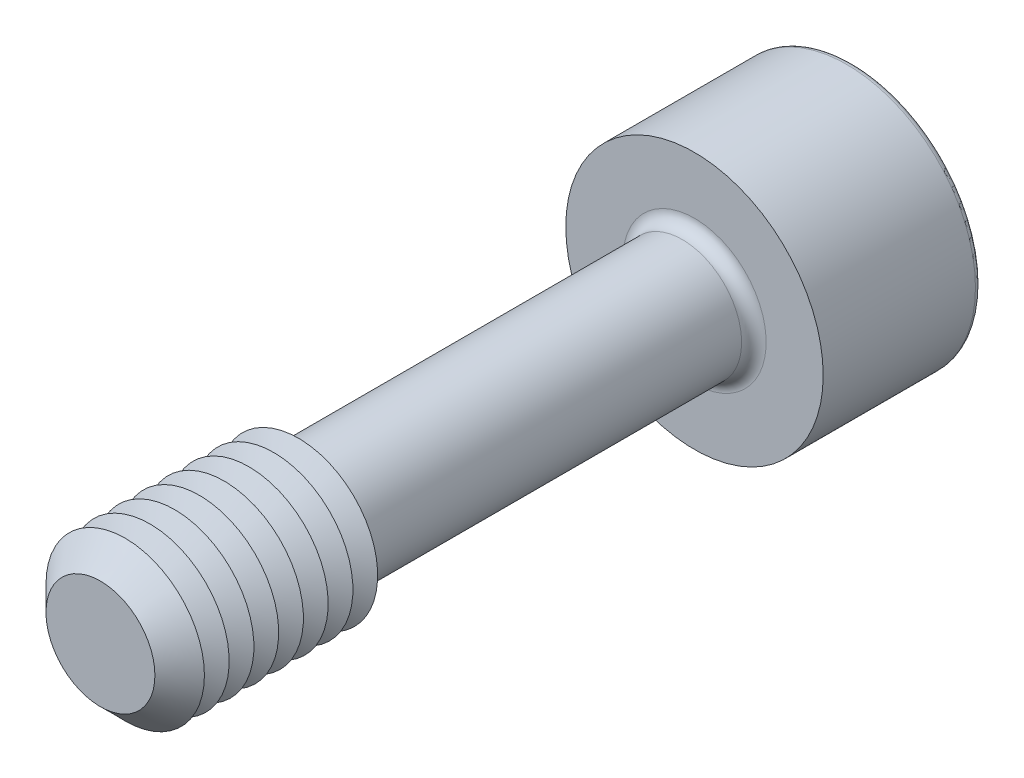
from build123d import *

# Parameters (mm, degrees)
SKETCH1_R       = 3
EXTRUDE1_DEPTH  = 15
CHAMFER1_SIZE   = 1.25
SKETCH3_R       = 6.5
EXTRUDE2_DEPTH  = 8
EXTRUDE3_DEPTH  = 6
FILLET1_R       = 0.62
FILLET2_R       = 0.31
LPATTERN1_COUNT = 7
LPATTERN1_PITCH = 1.25


with BuildPart() as part:
    # Sketch1 → Extrude1 (new, symmetric)
    with BuildSketch(Plane.XY):
        Circle(SKETCH1_R)
    extrude(amount=EXTRUDE1_DEPTH, both=True)

    # Sketch2 → Revolve1 (revolve)
    with BuildSketch(Plane(origin=(0, 0, 0), x_dir=(0, 0, -1), z_dir=(1, 0, 0))):
        Polygon((-15, 0), (-15, 4), (-5, 4), (-4.422649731, 3), (-4.422649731, 0), align=None)
    revolve(axis=Axis((0, 0, 4.422649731), (0, 0, 1)))

    # Chamfer1
    chamfer1_edges = [part.edges().sort_by_distance(p)[0] for p in [
        (0, -4, 15),
    ]]
    chamfer(chamfer1_edges, length=CHAMFER1_SIZE)

    # Sketch3 → Extrude2 (add)
    with BuildSketch(Plane(origin=(0, 0, -15), x_dir=(-1, 0, 0), z_dir=(0, 0, -1))):
        Circle(SKETCH3_R)
    extrude(amount=EXTRUDE2_DEPTH)

    # Sketch4 → Extrude3 (cut)
    with BuildSketch(Plane(origin=(-13.7, 0, -23), x_dir=(1, 0, 0), z_dir=(0, 0, 1))):
        Polygon((11.967949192, -3), (15.432050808, -3), (17.164101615, 0), (15.432050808, 3), (11.967949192, 3), (10.235898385, 0), align=None)
    extrude(amount=EXTRUDE3_DEPTH, mode=Mode.SUBTRACT)

    # Fillet1
    fillet1_edges = [part.edges().sort_by_distance(p)[0] for p in [
        (-3, 0, -15),
    ]]
    fillet(fillet1_edges, radius=FILLET1_R)

    # Fillet2
    fillet2_edges = [part.edges().sort_by_distance(p)[0] for p in [
        (6.5, 0, -23),
    ]]
    fillet(fillet2_edges, radius=FILLET2_R)

    # Sketch5 → Cut-Revolve1 (revolve, cut)
    with BuildSketch(Plane(origin=(0, 0, 0), x_dir=(0, 0, -1), z_dir=(1, 0, 0)), mode=Mode.PRIVATE) as cut_revolve1_sk:
        Polygon((17, 0), (17, -3), (15.267949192, 0), align=None)
    revolve(cut_revolve1_sk.sketch.rotate(Axis((0, 0, -15.267949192), (0, 0, -1)), 90), axis=Axis((0, 0, -15.267949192), (0, 0, -1)), mode=Mode.SUBTRACT)

    # Sketch7 → Cut-Revolve2 (revolve, cut)
    with BuildSketch(Plane(origin=(0, 0, 0), x_dir=(0, 0, -1), z_dir=(1, 0, 0)), mode=Mode.PRIVATE) as cut_revolve2_sk:
        Polygon((-5, 4), (-5.625, 2.917468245), (-6.25, 4), align=None)
    cut_revolve2 = revolve(cut_revolve2_sk.sketch.rotate(Axis((0, 0, -1.332048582), (0, 0, 1)), 90), axis=Axis((0, 0, -1.332048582), (0, 0, 1)), mode=Mode.SUBTRACT)

    # LPattern1: Cut-Revolve2 ×7
    with Locations(*[(0, 0, i * LPATTERN1_PITCH) for i in range(1, LPATTERN1_COUNT)]):
        add(cut_revolve2, mode=Mode.SUBTRACT)


solid = part.part
